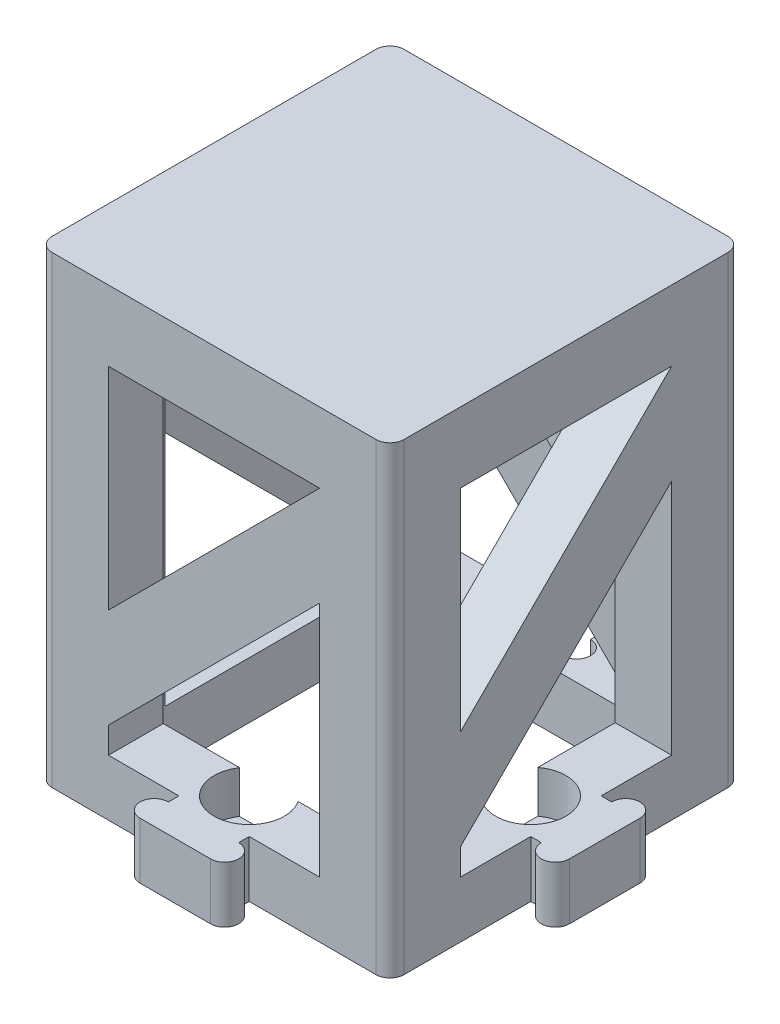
from build123d import *

# Parameters (mm, degrees)
SKETCH2_R            = 2.55
BOSS_EXTRUDE2_DEPTH  = 8
SKETCH3_R            = 5
CUT_EXTRUDE1_DEPTH   = 6
SKETCH5_R            = 3
BOSS_EXTRUDE3_DEPTH  = 4.5
SKETCH6_R            = 2.55
BOSS_EXTRUDE4_DEPTH  = 102
SKETCH7_R            = 2.55
BOSS_EXTRUDE5_DEPTH  = 98.5
BOSS_EXTRUDE8_START  = -7.782086
BOSS_EXTRUDE8_DEPTH  = 7.782086
BOSS_EXTRUDE9_DEPTH  = 7.782086
BOSS_EXTRUDE10_DEPTH = 7.78209
BOSS_EXTRUDE11_DEPTH = 7.782086
BOSS_EXTRUDE12_START = -54.142136
BOSS_EXTRUDE12_DEPTH = 54.142136
SKETCH16_W           = 50
SKETCH16_H           = 44.142135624
CUT_EXTRUDE2_DEPTH   = 125.620423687


with BuildPart() as part:
    # Sketch2 → Boss-Extrude2 (new body)
    # profile 1 of 3: a face of its own
    with BuildSketch(Plane(origin=(0, 0, 0), x_dir=(1, 0, 0), z_dir=(0, 1, 0))):
        with BuildLine():
            Line((-25, 5), (-23.5, 5))
            ThreePointArc((-23.5, 5), (-21.5, 7), (-19.5, 5))
            Line((-19.5, 5), (-19.5, -5))
            ThreePointArc((-19.5, -5), (-21.5, -7), (-23.5, -5))
            Line((-23.5, -5), (-25, -5))
            Line((-25, -5), (-25, -23))
            ThreePointArc((-25, -23), (-24.414213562, -24.414213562), (-23, -25))
            Line((-23, -25), (23, -25))
            ThreePointArc((23, -25), (24.414213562, -24.414213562), (25, -23))
            Line((25, -23), (25, 23))
            ThreePointArc((25, 23), (24.414213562, 24.414213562), (23, 25))
            Line((23, 25), (5, 25))
            Line((5, 25), (5, 23.5))
            ThreePointArc((5, 23.5), (7, 21.5), (5, 19.5))
            Line((5, 19.5), (-5, 19.5))
            ThreePointArc((-5, 19.5), (-7, 21.5), (-5, 23.5))
            Line((-5, 23.5), (-5, 25))
            Line((-5, 25), (-23, 25))
            ThreePointArc((-23, 25), (-24.414213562, 24.414213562), (-25, 23))
            Line((-25, 23), (-25, 5))
        make_face()
        with Locations(Location((20, -20, 0), (0, 0, 270))):
            Circle(SKETCH2_R, mode=Mode.SUBTRACT)
        with Locations(Location((20, 20, 0), (0, 0, 270))):
            Circle(SKETCH2_R, mode=Mode.SUBTRACT)
        with Locations(Location((-20, 20, 0), (0, 0, 270))):
            Circle(SKETCH2_R, mode=Mode.SUBTRACT)
        with Locations(Location((-20, -20, 0), (0, 0, 270))):
            Circle(SKETCH2_R, mode=Mode.SUBTRACT)
        with BuildLine():
            ThreePointArc((17, -1.25), (23.25, 0), (17, 1.25))
            Line((17, 1.25), (17, 15.217914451))
            ThreePointArc((17, 15.217914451), (16.414213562, 16.632128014), (15, 17.217914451))
            Line((15, 17.217914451), (-15, 17.217914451))
            ThreePointArc((-15, 17.217914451), (-16.414213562, 16.632128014), (-17, 15.217914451))
            Line((-17, 15.217914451), (-17, -15.217914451))
            ThreePointArc((-17, -15.217914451), (-16.414213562, -16.632128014), (-15, -17.217914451))
            Line((-15, -17.217914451), (-1.25, -17.217914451))
            ThreePointArc((-1.25, -17.217914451), (0, -23.05), (1.25, -17.217914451))
            Line((1.25, -17.217914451), (15, -17.217914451))
            ThreePointArc((15, -17.217914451), (16.414213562, -16.632128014), (17, -15.217914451))
            Line((17, -15.217914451), (17, -1.25))
        make_face(mode=Mode.SUBTRACT)
    # profile 2 of 3: a face of its own
    with BuildSketch(Plane(origin=(0, 0, 0), x_dir=(1, 0, 0), z_dir=(0, 1, 0))):
        with BuildLine():
            Line((5, -26.5), (5, -25))
            Line((5, -25), (-5, -25))
            Line((-5, -25), (-5, -26.5))
            ThreePointArc((-5, -26.5), (-7, -28.5), (-5, -30.5))
            Line((-5, -30.5), (5, -30.5))
            ThreePointArc((5, -30.5), (7, -28.5), (5, -26.5))
        make_face()
    # profile 3 of 3: a face of its own
    with BuildSketch(Plane(origin=(0, 0, 0), x_dir=(1, 0, 0), z_dir=(0, 1, 0))):
        with BuildLine():
            Line((25, 5), (25, -5))
            Line((25, -5), (26.5, -5))
            ThreePointArc((26.5, -5), (28.5, -7), (30.5, -5))
            Line((30.5, -5), (30.5, 5))
            ThreePointArc((30.5, 5), (28.5, 7), (26.5, 5))
            Line((26.5, 5), (25, 5))
        make_face()
    extrude(amount=BOSS_EXTRUDE2_DEPTH)

    # Sketch3 → Cut-Extrude1 (cut)
    with BuildSketch(Plane(origin=(0, 8, 0), x_dir=(1, 0, 0), z_dir=(0, 1, 0))):
        with Locations((0, -20)):
            Circle(SKETCH3_R)
        with Locations((20, 0)):
            Circle(SKETCH3_R)
    extrude(amount=-CUT_EXTRUDE1_DEPTH, mode=Mode.SUBTRACT)

    # Sketch5 → Boss-Extrude3 (add)
    with BuildSketch(Plane.XZ):
        with Locations((-20, 20)):
            Circle(SKETCH5_R)
        with Locations((20, 20)):
            Circle(SKETCH5_R)
        with Locations((20, -20)):
            Circle(SKETCH5_R)
        with Locations((-20, -20)):
            Circle(SKETCH5_R)
    extrude(amount=-BOSS_EXTRUDE3_DEPTH)

    # Sketch6 → Boss-Extrude4 (add)
    # profile 1 of 4: a face of its own
    with BuildSketch(Plane(origin=(0, 8, 0), x_dir=(1, 0, 0), z_dir=(0, 1, 0))):
        with BuildLine():
            Line((-17, -15.217914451), (-17, -15))
            Line((-17, -15), (-25, -15))
            Line((-25, -15), (-25, -23))
            ThreePointArc((-25, -23), (-24.414213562, -24.414213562), (-23, -25))
            Line((-23, -25), (-15, -25))
            Line((-15, -25), (-15, -17.217914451))
            ThreePointArc((-15, -17.217914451), (-16.414213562, -16.632128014), (-17, -15.217914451))
        make_face()
        with Locations(Location((-20, -20, 0), (0, 0, 90))):
            Circle(SKETCH6_R, mode=Mode.SUBTRACT)
    # profile 2 of 4: a face of its own
    with BuildSketch(Plane(origin=(0, 8, 0), x_dir=(1, 0, 0), z_dir=(0, 1, 0))):
        with BuildLine():
            ThreePointArc((17.217914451, -15), (17.034794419, -15.836030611), (16.518967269, -16.518967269))
            ThreePointArc((16.518967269, -16.518967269), (15.836030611, -17.034794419), (15, -17.217914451))
            Line((15, -17.217914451), (15, -25))
            Line((15, -25), (23, -25))
            ThreePointArc((23, -25), (24.414213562, -24.414213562), (25, -23))
            Line((25, -23), (25, -15))
            Line((25, -15), (17.217914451, -15))
        make_face()
        with Locations(Location((20, -20, 0), (0, 0, 90))):
            Circle(SKETCH6_R, mode=Mode.SUBTRACT)
    # profile 3 of 4: a face of its own
    with BuildSketch(Plane(origin=(0, 8, 0), x_dir=(1, 0, 0), z_dir=(0, 1, 0))):
        with BuildLine():
            ThreePointArc((15, 17.217914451), (16.414213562, 16.632128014), (17, 15.217914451))
            Line((17, 15.217914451), (17, 15))
            Line((17, 15), (25, 15))
            Line((25, 15), (25, 23))
            ThreePointArc((25, 23), (24.414213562, 24.414213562), (23, 25))
            Line((23, 25), (15, 25))
            Line((15, 25), (15, 17.217914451))
        make_face()
        with Locations(Location((20, 20, 0), (0, 0, 90))):
            Circle(SKETCH6_R, mode=Mode.SUBTRACT)
    # profile 4 of 4: a face of its own
    with BuildSketch(Plane(origin=(0, 8, 0), x_dir=(1, 0, 0), z_dir=(0, 1, 0))):
        with BuildLine():
            ThreePointArc((-17.217914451, 15), (-17.034794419, 15.836030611), (-16.518967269, 16.518967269))
            ThreePointArc((-16.518967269, 16.518967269), (-15.836030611, 17.034794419), (-15, 17.217914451))
            Line((-15, 17.217914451), (-15, 25))
            Line((-15, 25), (-23, 25))
            ThreePointArc((-23, 25), (-24.414213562, 24.414213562), (-25, 23))
            Line((-25, 23), (-25, 15))
            Line((-25, 15), (-17.217914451, 15))
        make_face()
        with Locations(Location((-20, 20, 0), (0, 0, 90))):
            Circle(SKETCH6_R, mode=Mode.SUBTRACT)
    extrude(amount=BOSS_EXTRUDE4_DEPTH)

    # Sketch7 → Boss-Extrude5 (add)
    with BuildSketch(Plane(origin=(0, 8, 0), x_dir=(1, 0, 0), z_dir=(0, 1, 0))):
        with Locations(Location((-20, 20, 0), (0, 0, 270))):
            Circle(SKETCH7_R)
        with Locations(Location((-20, -20, 0), (0, 0, 270))):
            Circle(SKETCH7_R)
        with Locations(Location((20, -20, 0), (0, 0, 270))):
            Circle(SKETCH7_R)
        with Locations(Location((20, 20, 0), (0, 0, 270))):
            Circle(SKETCH7_R)
    extrude(amount=BOSS_EXTRUDE5_DEPTH)

    # Sketch8 → Boss-Extrude8 (add)
    with BuildSketch(Plane(origin=(25, 0, 0), x_dir=(0, 0, -1), z_dir=(1, 0, 0)).offset(BOSS_EXTRUDE8_START)):
        Polygon((-15, 25.857864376), (-15, 11.715728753), (15, 41.715728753), (15, 55.857864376), align=None)
        Polygon((-15, 85.857864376), (15, 55.857864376), (15, 70), (-15, 100), align=None)
    extrude(amount=BOSS_EXTRUDE8_DEPTH)

    # Sketch12 → Boss-Extrude9 (add)
    with BuildSketch(Plane(origin=(0, 0, -25), x_dir=(-1, 0, 0), z_dir=(0, 0, -1))):
        Polygon((-15, 25.857864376), (-15, 11.715728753), (15, 41.715728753), (15, 55.857864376), align=None)
        Polygon((15, 55.857864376), (-15, 85.857864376), (-15, 100), (15, 70), align=None)
    extrude(amount=-BOSS_EXTRUDE9_DEPTH)

    # Sketch13 → Boss-Extrude10 (add)
    with BuildSketch(Plane.ZY.offset(25)):
        Polygon((-15, 85.857864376), (15, 55.857864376), (15, 70), (-15, 100), align=None)
        Polygon((-15, 25.857864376), (-15, 11.715728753), (15, 41.715728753), (15, 55.857864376), align=None)
    extrude(amount=-BOSS_EXTRUDE10_DEPTH)

    # Sketch14 → Boss-Extrude11 (add)
    with BuildSketch(Plane.XY.offset(25)):
        Polygon((-15, 85.857864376), (15, 55.857864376), (15, 70), (-15, 100), align=None)
        Polygon((-15, 25.857864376), (-15, 11.715728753), (15, 41.715728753), (15, 55.857864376), align=None)
    extrude(amount=-BOSS_EXTRUDE11_DEPTH)

    # Sketch15 → Boss-Extrude12 (add)
    with BuildSketch(Plane(origin=(0, 110, 0), x_dir=(1, 0, 0), z_dir=(0, 1, 0)).offset(BOSS_EXTRUDE12_START)):
        with BuildLine():
            Line((-25, 23), (-25, -23))
            ThreePointArc((-25, -23), (-24.414213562, -24.414213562), (-23, -25))
            Line((-23, -25), (23, -25))
            ThreePointArc((23, -25), (24.414213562, -24.414213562), (25, -23))
            Line((25, -23), (25, 23))
            ThreePointArc((25, 23), (24.414213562, 24.414213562), (23, 25))
            Line((23, 25), (-23, 25))
            ThreePointArc((-23, 25), (-24.414213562, 24.414213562), (-25, 23))
        make_face()
    extrude(amount=BOSS_EXTRUDE12_DEPTH)

    # Sketch16 → Cut-Extrude2 (cut, through all)
    with BuildSketch(Plane.XY.offset(25)):
        with Locations((0, 87.928932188)):
            Rectangle(SKETCH16_W, SKETCH16_H)
    extrude(amount=-CUT_EXTRUDE2_DEPTH, mode=Mode.SUBTRACT)


solid = part.part
